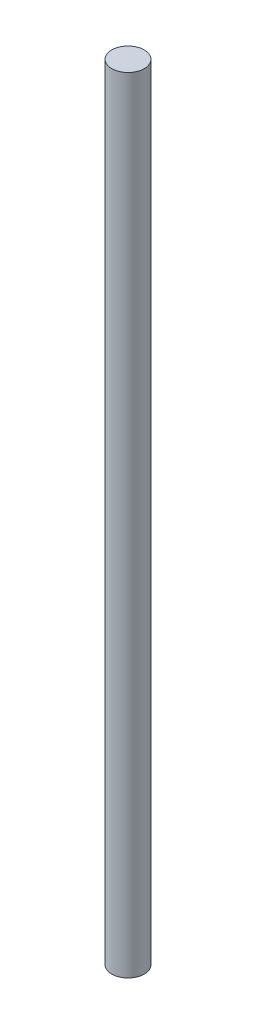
from build123d import *

# Parameters (mm, degrees)
SKETCH1_R           = 1.57734
BOSS_EXTRUDE1_DEPTH = 76.2


with BuildPart() as part:
    # Sketch1 → Boss-Extrude1 (new body)
    with BuildSketch(Plane(origin=(0, 0, 0), x_dir=(1, 0, 0), z_dir=(0, 1, 0))):
        with Locations(Location((0, 0, 0), (0, 0, 270))):
            Circle(SKETCH1_R)
    extrude(amount=BOSS_EXTRUDE1_DEPTH)


solid = part.part
